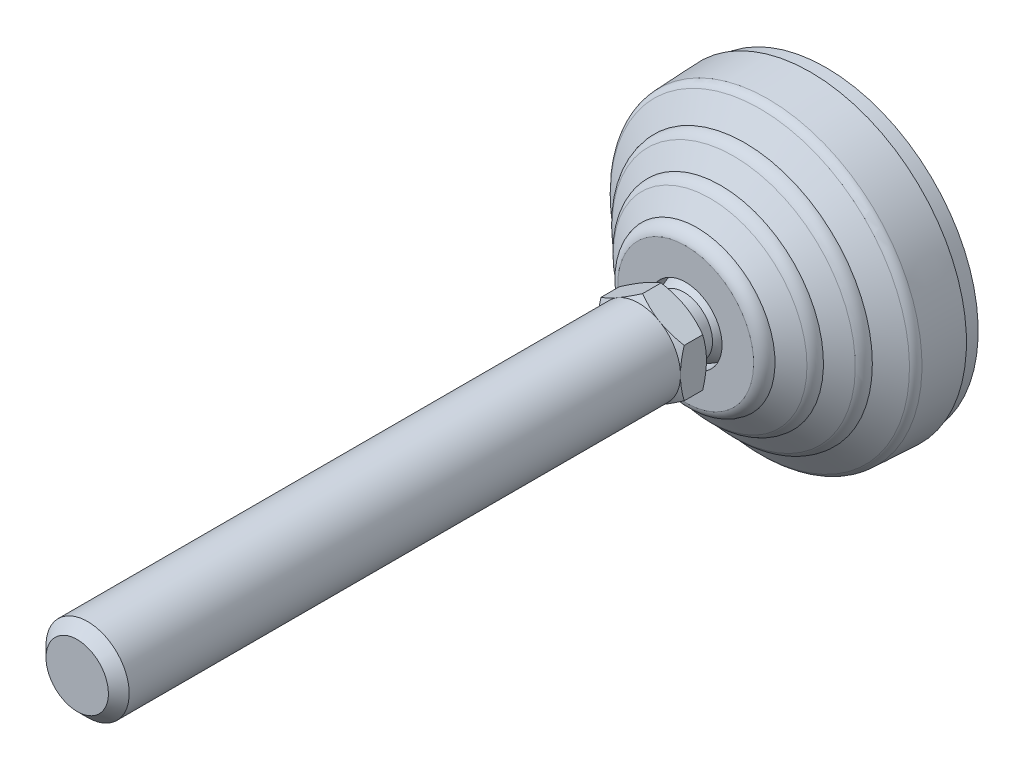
ISO-10303-21;
HEADER;
FILE_DESCRIPTION(('STEP AP214'),'2;1');
FILE_NAME('part.step','',(''),(''),'','','');
FILE_SCHEMA(('AUTOMOTIVE_DESIGN { 1 0 10303 214 1 1 1 1 }'));
ENDSEC;
DATA;
#1=APPLICATION_CONTEXT('core data for automotive mechanical design processes');
#2=APPLICATION_PROTOCOL_DEFINITION('international standard','automotive_design',2000,#1);
#3=PRODUCT_CONTEXT('',#1,'mechanical');
#4=PRODUCT('Part','Part','',(#3));
#5=PRODUCT_RELATED_PRODUCT_CATEGORY('part','',(#4));
#6=PRODUCT_DEFINITION_FORMATION('','',#4);
#7=PRODUCT_DEFINITION_CONTEXT('part definition',#1,'design');
#8=PRODUCT_DEFINITION('design','',#6,#7);
#9=PRODUCT_DEFINITION_SHAPE('','',#8);
#10=(LENGTH_UNIT() NAMED_UNIT(*) SI_UNIT(.MILLI.,.METRE.));
#11=(NAMED_UNIT(*) PLANE_ANGLE_UNIT() SI_UNIT($,.RADIAN.));
#12=(NAMED_UNIT(*) SI_UNIT($,.STERADIAN.) SOLID_ANGLE_UNIT());
#13=UNCERTAINTY_MEASURE_WITH_UNIT(LENGTH_MEASURE(1.E-05),#10,'distance_accuracy_value','');
#14=(GEOMETRIC_REPRESENTATION_CONTEXT(3) GLOBAL_UNCERTAINTY_ASSIGNED_CONTEXT((#13)) GLOBAL_UNIT_ASSIGNED_CONTEXT((#10,
#11,#12)) REPRESENTATION_CONTEXT('',''));
#15=CARTESIAN_POINT('',(0.,0.,0.));
#16=DIRECTION('',(0.,0.,1.));
#17=DIRECTION('',(1.,0.,0.));
#18=AXIS2_PLACEMENT_3D('',#15,#16,#17);
#19=CARTESIAN_POINT('',(0.,0.,35.2753734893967));
#20=DIRECTION('',(0.,0.,-1.));
#21=DIRECTION('',(0.,1.,0.));
#22=AXIS2_PLACEMENT_3D('',#19,#20,#21);
#23=CONICAL_SURFACE('',#22,9.2450899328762,1.0471975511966);
#24=CARTESIAN_POINT('',(0.,0.,36.));
#25=DIRECTION('',(0.,0.,-1.));
#26=DIRECTION('',(0.,1.,0.));
#27=AXIS2_PLACEMENT_3D('',#24,#25,#26);
#28=CIRCLE('',#27,7.99);
#29=CARTESIAN_POINT('',(0.,7.99,36.));
#30=VERTEX_POINT('',#29);
#31=EDGE_CURVE('E124',#30,#30,#28,.F.);
#32=ORIENTED_EDGE('',*,*,#31,.F.);
#33=EDGE_LOOP('',(#32));
#34=FACE_BOUND('',#33,.T.);
#35=CARTESIAN_POINT('',(-4.19327850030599E-08,-9.23760428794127,35.2796952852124));
#36=CARTESIAN_POINT('',(0.175847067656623,-9.13607893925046,35.3382996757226));
#37=CARTESIAN_POINT('',(0.352349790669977,-9.03417505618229,35.3942441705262));
#38=CARTESIAN_POINT('',(0.706788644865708,-8.82953969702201,35.5000807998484));
#39=CARTESIAN_POINT('',(0.884725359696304,-8.72680788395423,35.5499703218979));
#40=CARTESIAN_POINT('',(1.42138431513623,-8.41696768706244,35.6895770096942));
#41=CARTESIAN_POINT('',(1.78222493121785,-8.20863626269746,35.7689823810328));
#42=CARTESIAN_POINT('',(2.32221590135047,-7.896872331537,35.862092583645));
#43=CARTESIAN_POINT('',(2.49975318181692,-7.79437113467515,35.8886165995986));
#44=CARTESIAN_POINT('',(2.85563052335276,-7.58890525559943,35.9330919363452));
#45=CARTESIAN_POINT('',(3.03397051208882,-7.48594061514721,35.9510440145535));
#46=CARTESIAN_POINT('',(3.3909574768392,-7.27983409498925,35.9779205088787));
#47=CARTESIAN_POINT('',(3.56960387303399,-7.17669255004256,35.9868551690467));
#48=CARTESIAN_POINT('',(3.92706158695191,-6.97031424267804,35.9955052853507));
#49=CARTESIAN_POINT('',(4.10587289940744,-6.86707748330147,35.995221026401));
#50=CARTESIAN_POINT('',(4.44015430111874,-6.67408002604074,35.9860752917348));
#51=CARTESIAN_POINT('',(4.59564800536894,-6.58430569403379,35.9783294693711));
#52=CARTESIAN_POINT('',(4.90627121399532,-6.4049673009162,35.956016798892));
#53=CARTESIAN_POINT('',(5.06140069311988,-6.31540325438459,35.9414494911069));
#54=CARTESIAN_POINT('',(5.52618852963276,-6.04705787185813,35.8878596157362));
#55=CARTESIAN_POINT('',(5.83502420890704,-5.86875150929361,35.8389557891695));
#56=CARTESIAN_POINT('',(6.455971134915,-5.51024763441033,35.7166979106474));
#57=CARTESIAN_POINT('',(6.76800315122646,-5.33009586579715,35.6428257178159));
#58=CARTESIAN_POINT('',(7.38741452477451,-4.97247854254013,35.4751673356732));
#59=CARTESIAN_POINT('',(7.69480181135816,-4.79500840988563,35.3814205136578));
#60=CARTESIAN_POINT('',(7.9999999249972,-4.6188021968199,35.2796953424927));
#61=B_SPLINE_CURVE_WITH_KNOTS('',3,(#35,#36,#37,#38,#39,#40,#41,#42,#43,#44,#45,#46,#47,#48,#49,
#50,#51,#52,#53,#54,#55,#56,#57,#58,#59,#60),.UNSPECIFIED.,.F.,.F.,(4,2,2,2,2,2,2,2,2,2,2,2,4),
(0.,0.633965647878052,1.26820386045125,2.53931509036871,3.15930425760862,3.77923863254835,
4.39846794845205,5.01767812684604,5.55669080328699,6.09573980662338,7.17460542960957,
8.2773951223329,9.37802050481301),.UNSPECIFIED.);
#62=CARTESIAN_POINT('',(-1.44240226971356E-08,-9.23760431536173,35.2796953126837));
#63=VERTEX_POINT('',#62);
#64=CARTESIAN_POINT('',(8.,-4.61880217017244,35.2796953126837));
#65=VERTEX_POINT('',#64);
#66=EDGE_CURVE('E140',#63,#65,#61,.T.);
#67=ORIENTED_EDGE('',*,*,#66,.T.);
#68=CARTESIAN_POINT('',(7.9999999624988,-4.6188021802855,35.2796952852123));
#69=CARTESIAN_POINT('',(7.99999998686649,-4.23969380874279,35.3891659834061));
#70=CARTESIAN_POINT('',(7.999999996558,-3.85751175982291,35.4893813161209));
#71=CARTESIAN_POINT('',(8.00000000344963,-3.08693961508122,35.6664987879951));
#72=CARTESIAN_POINT('',(8.00000000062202,-2.69853763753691,35.7433487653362));
#73=CARTESIAN_POINT('',(7.99999999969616,-2.11699996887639,35.8364192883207));
#74=CARTESIAN_POINT('',(7.99999999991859,-1.92560834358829,35.8635449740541));
#75=CARTESIAN_POINT('',(8.0000000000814,-1.54193621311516,35.9104602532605));
#76=CARTESIAN_POINT('',(8.0000000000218,-1.34965578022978,35.9302504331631));
#77=CARTESIAN_POINT('',(7.99999999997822,-0.96464588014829,35.962068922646));
#78=CARTESIAN_POINT('',(7.99999999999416,-0.771917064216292,35.9741050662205));
#79=CARTESIAN_POINT('',(8.00000000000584,-0.386125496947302,35.9901838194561));
#80=CARTESIAN_POINT('',(8.00000000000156,-0.193062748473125,35.9942264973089));
#81=CARTESIAN_POINT('',(7.99999999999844,0.193062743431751,35.9942264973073));
#82=CARTESIAN_POINT('',(7.99999999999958,0.38612548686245,35.9901838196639));
#83=CARTESIAN_POINT('',(8.00000000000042,0.771917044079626,35.9741050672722));
#84=CARTESIAN_POINT('',(8.00000000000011,0.964645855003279,35.962068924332));
#85=CARTESIAN_POINT('',(7.99999999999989,1.34965574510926,35.930250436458));
#86=CARTESIAN_POINT('',(7.99999999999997,1.54193617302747,35.9104602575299));
#87=CARTESIAN_POINT('',(8.00000000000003,1.92560829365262,35.8635449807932));
#88=CARTESIAN_POINT('',(8.00000000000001,2.11699991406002,35.8364192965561));
#89=CARTESIAN_POINT('',(7.99999999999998,2.69853756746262,35.7433487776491));
#90=CARTESIAN_POINT('',(7.99999999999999,3.0869395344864,35.6664988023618));
#91=CARTESIAN_POINT('',(8.00000000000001,3.85751166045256,35.4893813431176));
#92=CARTESIAN_POINT('',(8.00000000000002,4.23969370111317,35.3891660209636));
#93=CARTESIAN_POINT('',(8.,4.61880206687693,35.2796953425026));
#94=B_SPLINE_CURVE_WITH_KNOTS('',3,(#68,#69,#70,#71,#72,#73,#74,#75,#76,#77,#78,#79,#80,#81,#82,
#83,#84,#85,#86,#87,#88,#89,#90,#91,#92,#93),.UNSPECIFIED.,.F.,.F.,(4,2,2,2,2,2,2,2,2,2,2,2,4),
(0.,1.1842935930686,2.37121196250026,2.95099639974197,3.53073447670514,4.10988591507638,
4.68903241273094,5.26817889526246,5.84733031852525,6.42706838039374,7.00685280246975,
8.19377114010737,9.37806470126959),.UNSPECIFIED.);
#95=CARTESIAN_POINT('',(8.00000001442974,4.618802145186,35.2796953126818));
#96=VERTEX_POINT('',#95);
#97=EDGE_CURVE('E132',#65,#96,#94,.T.);
#98=ORIENTED_EDGE('',*,*,#97,.T.);
#99=CARTESIAN_POINT('',(8.00000000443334,4.61880210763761,35.2796952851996));
#100=CARTESIAN_POINT('',(7.82415291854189,4.72032749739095,35.3382996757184));
#101=CARTESIAN_POINT('',(7.64765020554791,4.8222313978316,35.3942441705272));
#102=CARTESIAN_POINT('',(7.29321135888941,5.02686677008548,35.500080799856));
#103=CARTESIAN_POINT('',(7.11527464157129,5.12959857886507,35.549970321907));
#104=CARTESIAN_POINT('',(6.57861568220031,5.43943876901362,35.689577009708));
#105=CARTESIAN_POINT('',(6.21777506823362,5.6477701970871,35.7689823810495));
#106=CARTESIAN_POINT('',(5.67778409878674,5.95953412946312,35.8620925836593));
#107=CARTESIAN_POINT('',(5.50024681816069,6.06203532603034,35.8886165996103));
#108=CARTESIAN_POINT('',(5.14436947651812,6.2675012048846,35.9330919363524));
#109=CARTESIAN_POINT('',(4.96602948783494,6.37046584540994,35.9510440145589));
#110=CARTESIAN_POINT('',(4.60904252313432,6.57657236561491,35.977920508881));
#111=CARTESIAN_POINT('',(4.43039612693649,6.6797139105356,35.986855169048));
#112=CARTESIAN_POINT('',(4.0729384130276,6.88609221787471,35.9955052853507));
#113=CARTESIAN_POINT('',(3.89412710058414,6.98932897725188,35.9952210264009));
#114=CARTESIAN_POINT('',(3.55984569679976,7.18232643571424,35.9860752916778));
#115=CARTESIAN_POINT('',(3.40435199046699,7.27210076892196,35.9783294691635));
#116=CARTESIAN_POINT('',(3.09372877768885,7.45143916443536,35.956016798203));
#117=CARTESIAN_POINT('',(2.9385992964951,7.54100321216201,35.9414494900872));
#118=CARTESIAN_POINT('',(2.47381145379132,7.80934859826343,35.8878596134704));
#119=CARTESIAN_POINT('',(2.16497577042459,7.98765496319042,35.8389557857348));
#120=CARTESIAN_POINT('',(1.54402883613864,8.34615884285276,35.7166979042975));
#121=CARTESIAN_POINT('',(1.23199681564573,8.52631061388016,35.6428257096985));
#122=CARTESIAN_POINT('',(0.612585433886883,8.88392794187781,35.4751673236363));
#123=CARTESIAN_POINT('',(0.305198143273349,9.06139807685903,35.3814204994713));
#124=CARTESIAN_POINT('',(2.56600557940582E-08,9.23760429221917,35.2796953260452));
#125=B_SPLINE_CURVE_WITH_KNOTS('',3,(#99,#100,#101,#102,#103,#104,#105,#106,#107,#108,#109,#110,
#111,#112,#113,#114,#115,#116,#117,#118,#119,#120,#121,#122,#123,#124),.UNSPECIFIED.,.F.,.F.,(4,
2,2,2,2,2,2,2,2,2,2,2,4),(0.,0.63396564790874,1.26820386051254,2.53931509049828,
3.15930425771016,3.77923863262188,4.39846794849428,5.01767812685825,5.55669081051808,
6.0957398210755,7.17460545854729,8.27739516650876,9.37802056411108),.UNSPECIFIED.);
#126=CARTESIAN_POINT('',(-1.1538685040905E-08,9.23760430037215,35.279695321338));
#127=VERTEX_POINT('',#126);
#128=EDGE_CURVE('E176',#96,#127,#125,.T.);
#129=ORIENTED_EDGE('',*,*,#128,.T.);
#130=CARTESIAN_POINT('',(-1.65350869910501E-08,9.23760427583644,35.2796953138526));
#131=CARTESIAN_POINT('',(-0.175847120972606,9.13607891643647,35.3382996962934));
#132=CARTESIAN_POINT('',(-0.352349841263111,9.03417502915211,35.3942441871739));
#133=CARTESIAN_POINT('',(-0.7067886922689,8.82953966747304,35.5000808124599));
#134=CARTESIAN_POINT('',(-0.884725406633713,8.72680785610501,35.5499703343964));
#135=CARTESIAN_POINT('',(-1.42138436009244,8.41696766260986,35.6895770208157));
#136=CARTESIAN_POINT('',(-1.78222497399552,8.2086362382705,35.7689823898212));
#137=CARTESIAN_POINT('',(-2.32221594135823,7.89687230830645,35.8620925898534));
#138=CARTESIAN_POINT('',(-2.4997532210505,7.79437111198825,35.8886166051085));
#139=CARTESIAN_POINT('',(-2.85563056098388,7.58890523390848,35.9330919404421));
#140=CARTESIAN_POINT('',(-3.03397054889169,7.48594059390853,35.9510440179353));
#141=CARTESIAN_POINT('',(-3.39095751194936,7.27983407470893,35.9779205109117));
#142=CARTESIAN_POINT('',(-3.56960390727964,7.1766925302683,35.9868551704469));
#143=CARTESIAN_POINT('',(-3.92706161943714,6.97031422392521,35.9955052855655));
#144=CARTESIAN_POINT('',(-4.10587293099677,6.86707746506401,35.9952210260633));
#145=CARTESIAN_POINT('',(-4.44015433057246,6.67408000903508,35.9860752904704));
#146=CARTESIAN_POINT('',(-4.59564803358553,6.58430567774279,35.9783294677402));
#147=CARTESIAN_POINT('',(-4.90627123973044,6.40496728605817,35.956016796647));
#148=CARTESIAN_POINT('',(-5.06140071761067,6.31540324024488,35.9414494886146));
#149=CARTESIAN_POINT('',(-5.52618855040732,6.04705785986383,35.8878596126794));
#150=CARTESIAN_POINT('',(-5.83502422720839,5.8687514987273,35.8389557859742));
#151=CARTESIAN_POINT('',(-6.45597114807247,5.51024762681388,35.7166979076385));
#152=CARTESIAN_POINT('',(-6.76800316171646,5.33009585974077,35.6428257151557));
#153=CARTESIAN_POINT('',(-7.38741452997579,4.97247853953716,35.4751673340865));
#154=CARTESIAN_POINT('',(-7.69480181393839,4.7950084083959,35.381420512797));
#155=CARTESIAN_POINT('',(-7.9999999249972,4.6188021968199,35.2796953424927));
#156=B_SPLINE_CURVE_WITH_KNOTS('',3,(#130,#131,#132,#133,#134,#135,#136,#137,#138,#139,#140,
#141,#142,#143,#144,#145,#146,#147,#148,#149,#150,#151,#152,#153,#154,#155),.UNSPECIFIED.,.F.,
.F.,(4,2,2,2,2,2,2,2,2,2,2,2,4),(0.,0.633965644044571,1.26820385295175,2.53931507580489,
3.15930423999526,3.77923861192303,4.39846792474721,5.01767810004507,5.55669077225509,
6.09573977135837,7.17460538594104,8.27739506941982,9.37802044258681),.UNSPECIFIED.);
#157=CARTESIAN_POINT('',(-8.,4.61880217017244,35.2796953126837));
#158=VERTEX_POINT('',#157);
#159=EDGE_CURVE('E168',#127,#158,#156,.T.);
#160=ORIENTED_EDGE('',*,*,#159,.T.);
#161=CARTESIAN_POINT('',(-7.9999999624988,4.6188021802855,35.2796952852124));
#162=CARTESIAN_POINT('',(-7.99999998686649,4.23969380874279,35.3891659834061));
#163=CARTESIAN_POINT('',(-7.999999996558,3.8575117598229,35.4893813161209));
#164=CARTESIAN_POINT('',(-8.00000000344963,3.08693961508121,35.6664987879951));
#165=CARTESIAN_POINT('',(-8.00000000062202,2.69853763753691,35.7433487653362));
#166=CARTESIAN_POINT('',(-7.99999999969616,2.11699996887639,35.8364192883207));
#167=CARTESIAN_POINT('',(-7.99999999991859,1.92560834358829,35.8635449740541));
#168=CARTESIAN_POINT('',(-8.0000000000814,1.54193621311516,35.9104602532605));
#169=CARTESIAN_POINT('',(-8.0000000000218,1.34965578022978,35.9302504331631));
#170=CARTESIAN_POINT('',(-7.99999999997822,0.964645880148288,35.962068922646));
#171=CARTESIAN_POINT('',(-7.99999999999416,0.77191706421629,35.9741050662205));
#172=CARTESIAN_POINT('',(-8.00000000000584,0.386125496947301,35.9901838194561));
#173=CARTESIAN_POINT('',(-8.00000000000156,0.193062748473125,35.9942264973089));
#174=CARTESIAN_POINT('',(-7.99999999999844,-0.193062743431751,35.9942264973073));
#175=CARTESIAN_POINT('',(-7.99999999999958,-0.38612548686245,35.9901838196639));
#176=CARTESIAN_POINT('',(-8.00000000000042,-0.771917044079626,35.9741050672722));
#177=CARTESIAN_POINT('',(-8.00000000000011,-0.964645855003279,35.962068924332));
#178=CARTESIAN_POINT('',(-7.99999999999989,-1.34965574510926,35.930250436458));
#179=CARTESIAN_POINT('',(-7.99999999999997,-1.54193617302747,35.9104602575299));
#180=CARTESIAN_POINT('',(-8.00000000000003,-1.92560829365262,35.8635449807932));
#181=CARTESIAN_POINT('',(-8.00000000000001,-2.11699991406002,35.8364192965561));
#182=CARTESIAN_POINT('',(-7.99999999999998,-2.69853756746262,35.7433487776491));
#183=CARTESIAN_POINT('',(-7.99999999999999,-3.0869395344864,35.6664988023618));
#184=CARTESIAN_POINT('',(-8.00000000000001,-3.85751166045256,35.4893813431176));
#185=CARTESIAN_POINT('',(-8.00000000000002,-4.23969370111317,35.3891660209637));
#186=CARTESIAN_POINT('',(-8.,-4.61880206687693,35.2796953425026));
#187=B_SPLINE_CURVE_WITH_KNOTS('',3,(#161,#162,#163,#164,#165,#166,#167,#168,#169,#170,#171,
#172,#173,#174,#175,#176,#177,#178,#179,#180,#181,#182,#183,#184,#185,#186),.UNSPECIFIED.,.F.,
.F.,(4,2,2,2,2,2,2,2,2,2,2,2,4),(0.,1.1842935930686,2.37121196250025,2.95099639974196,
3.53073447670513,4.10988591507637,4.68903241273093,5.26817889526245,5.84733031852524,
6.42706838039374,7.00685280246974,8.19377114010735,9.37806470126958),.UNSPECIFIED.);
#188=CARTESIAN_POINT('',(-8.00000001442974,-4.61880214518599,35.2796953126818));
#189=VERTEX_POINT('',#188);
#190=EDGE_CURVE('E358',#158,#189,#187,.T.);
#191=ORIENTED_EDGE('',*,*,#190,.T.);
#192=CARTESIAN_POINT('',(-8.00000000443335,-4.61880210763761,35.2796952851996));
#193=CARTESIAN_POINT('',(-7.82415291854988,-4.72032749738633,35.3382996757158));
#194=CARTESIAN_POINT('',(-7.64765020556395,-4.82223139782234,35.3942441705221));
#195=CARTESIAN_POINT('',(-7.29321135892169,-5.02686677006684,35.5000807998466));
#196=CARTESIAN_POINT('',(-7.11527464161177,-5.1295985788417,35.5499703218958));
#197=CARTESIAN_POINT('',(-6.57861568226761,-5.43943876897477,35.6895770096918));
#198=CARTESIAN_POINT('',(-6.21777506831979,-5.64777019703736,35.7689823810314));
#199=CARTESIAN_POINT('',(-5.67778409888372,-5.95953412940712,35.8620925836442));
#200=CARTESIAN_POINT('',(-5.50024681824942,-6.06203532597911,35.8886165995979));
#201=CARTESIAN_POINT('',(-5.14436947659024,-6.26750120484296,35.9330919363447));
#202=CARTESIAN_POINT('',(-4.9660294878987,-6.37046584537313,35.9510440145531));
#203=CARTESIAN_POINT('',(-4.60904252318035,-6.57657236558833,35.9779205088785));
#204=CARTESIAN_POINT('',(-4.43039612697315,-6.67971391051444,35.9868551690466));
#205=CARTESIAN_POINT('',(-4.07293841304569,-6.88609221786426,35.9955052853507));
#206=CARTESIAN_POINT('',(-3.89412710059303,-6.98932897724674,35.995221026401));
#207=CARTESIAN_POINT('',(-3.55984569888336,-7.18232643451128,35.9860752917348));
#208=CARTESIAN_POINT('',(-3.40435199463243,-7.27210076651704,35.9783294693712));
#209=CARTESIAN_POINT('',(-3.09372878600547,-7.45143915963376,35.9560167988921));
#210=CARTESIAN_POINT('',(-2.93859930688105,-7.54100320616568,35.941449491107));
#211=CARTESIAN_POINT('',(-2.47381147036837,-7.80934858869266,35.8878596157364));
#212=CARTESIAN_POINT('',(-2.16497579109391,-7.98765495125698,35.8389557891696));
#213=CARTESIAN_POINT('',(-1.54402886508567,-8.34615882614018,35.7166979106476));
#214=CARTESIAN_POINT('',(-1.23199684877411,-8.52631059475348,35.642825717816));
#215=CARTESIAN_POINT('',(-0.612585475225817,-8.88392791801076,35.4751673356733));
#216=CARTESIAN_POINT('',(-0.305198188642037,-9.06139805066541,35.3814205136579));
#217=CARTESIAN_POINT('',(-7.50027841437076E-08,-9.23760426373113,35.2796953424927));
#218=B_SPLINE_CURVE_WITH_KNOTS('',3,(#192,#193,#194,#195,#196,#197,#198,#199,#200,#201,#202,
#203,#204,#205,#206,#207,#208,#209,#210,#211,#212,#213,#214,#215,#216,#217),.UNSPECIFIED.,.F.,
.F.,(4,2,2,2,2,2,2,2,2,2,2,2,4),(0.,0.633965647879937,1.26820386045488,2.53931509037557,
3.15930425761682,3.77923863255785,4.39846794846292,5.01767812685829,5.55669080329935,
6.09573980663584,7.17460542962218,8.27739512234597,9.37802050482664),.UNSPECIFIED.);
#219=EDGE_CURVE('E158',#189,#63,#218,.T.);
#220=ORIENTED_EDGE('',*,*,#219,.T.);
#221=EDGE_LOOP('',(#67,#98,#129,#160,#191,#220));
#222=FACE_BOUND('',#221,.T.);
#223=ADVANCED_FACE('F14',(#34,#222),#23,.T.);
#224=CARTESIAN_POINT('',(0.,-9.23760430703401,36.1));
#225=DIRECTION('',(0.5,0.866025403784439,0.));
#226=DIRECTION('',(-0.866025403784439,0.5,0.));
#227=AXIS2_PLACEMENT_3D('',#224,#225,#226);
#228=PLANE('',#227);
#229=DIRECTION('',(0.,0.,1.));
#230=VECTOR('',#229,1.);
#231=CARTESIAN_POINT('',(0.,-9.23760430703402,36.1));
#232=LINE('',#231,#230);
#233=CARTESIAN_POINT('',(0.,-9.23760430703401,31.7203046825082));
#234=VERTEX_POINT('',#233);
#235=EDGE_CURVE('E339',#234,#63,#232,.T.);
#236=ORIENTED_EDGE('',*,*,#235,.T.);
#237=ORIENTED_EDGE('',*,*,#219,.F.);
#238=DIRECTION('',(0.,0.,1.));
#239=VECTOR('',#238,1.);
#240=CARTESIAN_POINT('',(-8.,-4.61880215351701,36.1));
#241=LINE('',#240,#239);
#242=CARTESIAN_POINT('',(-8.,-4.61880215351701,31.7203046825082));
#243=VERTEX_POINT('',#242);
#244=EDGE_CURVE('E342',#243,#189,#241,.T.);
#245=ORIENTED_EDGE('',*,*,#244,.F.);
#246=CARTESIAN_POINT('',(0.,-9.23760430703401,31.7203046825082));
#247=CARTESIAN_POINT('',(-0.175847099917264,-9.13607893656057,31.6617003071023));
#248=CARTESIAN_POINT('',(-0.352349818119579,-9.03417504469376,31.6057558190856));
#249=CARTESIAN_POINT('',(-0.706788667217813,-8.82953967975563,31.4999191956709));
#250=CARTESIAN_POINT('',(-0.884725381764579,-8.72680786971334,31.4500296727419));
#251=CARTESIAN_POINT('',(-1.42138433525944,-8.41696767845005,31.3104229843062));
#252=CARTESIAN_POINT('',(-1.78222494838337,-8.20863625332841,31.2310176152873));
#253=CARTESIAN_POINT('',(-2.32221591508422,-7.8968723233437,31.1379074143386));
#254=CARTESIAN_POINT('',(-2.49975319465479,-7.79437112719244,31.1113833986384));
#255=CARTESIAN_POINT('',(-2.85563053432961,-7.5889052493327,31.0669080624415));
#256=CARTESIAN_POINT('',(-3.03397052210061,-7.48594060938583,31.0489559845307));
#257=CARTESIAN_POINT('',(-3.39095748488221,-7.27983409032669,31.0220794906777));
#258=CARTESIAN_POINT('',(-3.56960388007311,-7.17669254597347,31.0131448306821));
#259=CARTESIAN_POINT('',(-3.9270615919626,-6.97031423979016,31.0044947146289));
#260=CARTESIAN_POINT('',(-4.10587290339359,-6.86707748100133,31.0047789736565));
#261=CARTESIAN_POINT('',(-4.44015430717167,-6.67408002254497,31.0139247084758));
#262=CARTESIAN_POINT('',(-4.59564801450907,-6.58430568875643,31.0216705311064));
#263=CARTESIAN_POINT('',(-4.90627122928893,-6.40496729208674,31.0439832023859));
#264=CARTESIAN_POINT('',(-5.06140071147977,-6.3154032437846,31.0585505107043));
#265=CARTESIAN_POINT('',(-5.52618855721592,-6.04705785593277,31.1121403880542));
#266=CARTESIAN_POINT('',(-5.83502424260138,-5.86875148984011,31.161044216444));
#267=CARTESIAN_POINT('',(-6.4559711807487,-5.51024760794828,31.283302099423));
#268=CARTESIAN_POINT('',(-6.76800320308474,-5.33009583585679,31.3571742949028));
#269=CARTESIAN_POINT('',(-7.38741458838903,-4.97247850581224,31.5248326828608));
#270=CARTESIAN_POINT('',(-7.69480188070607,-4.79500836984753,31.6185795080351));
#271=CARTESIAN_POINT('',(-8.,-4.61880215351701,31.7203046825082));
#272=B_SPLINE_CURVE_WITH_KNOTS('',3,(#246,#247,#248,#249,#250,#251,#252,#253,#254,#255,#256,
#257,#258,#259,#260,#261,#262,#263,#264,#265,#266,#267,#268,#269,#270,#271),.UNSPECIFIED.,.F.,
.F.,(4,2,2,2,2,2,2,2,2,2,2,2,4),(0.,0.633965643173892,1.26820385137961,2.53931507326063,
3.15930423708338,3.77923860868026,4.39846792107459,5.01767809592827,5.55669078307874,
6.09573979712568,7.17460544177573,8.27739515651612,9.37802056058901),.UNSPECIFIED.);
#273=EDGE_CURVE('E341',#234,#243,#272,.T.);
#274=ORIENTED_EDGE('',*,*,#273,.F.);
#275=EDGE_LOOP('',(#236,#237,#245,#274));
#276=FACE_BOUND('',#275,.T.);
#277=ADVANCED_FACE('F152',(#276),#228,.F.);
#278=CARTESIAN_POINT('',(8.,-4.61880215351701,36.1));
#279=DIRECTION('',(-0.5,0.866025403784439,0.));
#280=DIRECTION('',(-0.866025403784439,-0.5,0.));
#281=AXIS2_PLACEMENT_3D('',#278,#279,#280);
#282=PLANE('',#281);
#283=DIRECTION('',(0.,0.,1.));
#284=VECTOR('',#283,1.);
#285=CARTESIAN_POINT('',(8.,-4.61880215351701,36.1));
#286=LINE('',#285,#284);
#287=CARTESIAN_POINT('',(8.,-4.61880215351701,31.7203046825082));
#288=VERTEX_POINT('',#287);
#289=EDGE_CURVE('E31',#288,#65,#286,.T.);
#290=ORIENTED_EDGE('',*,*,#289,.T.);
#291=ORIENTED_EDGE('',*,*,#66,.F.);
#292=ORIENTED_EDGE('',*,*,#235,.F.);
#293=CARTESIAN_POINT('',(8.,-4.61880215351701,31.7203046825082));
#294=CARTESIAN_POINT('',(7.82415290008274,-4.72032752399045,31.6617003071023));
#295=CARTESIAN_POINT('',(7.64765018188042,-4.82223141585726,31.6057558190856));
#296=CARTESIAN_POINT('',(7.29321133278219,-5.02686678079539,31.4999191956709));
#297=CARTESIAN_POINT('',(7.11527461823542,-5.12959859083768,31.4500296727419));
#298=CARTESIAN_POINT('',(6.57861566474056,-5.43943878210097,31.3104229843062));
#299=CARTESIAN_POINT('',(6.21777505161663,-5.64777020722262,31.2310176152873));
#300=CARTESIAN_POINT('',(5.67778408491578,-5.95953413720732,31.1379074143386));
#301=CARTESIAN_POINT('',(5.5002468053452,-6.06203533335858,31.1113833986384));
#302=CARTESIAN_POINT('',(5.14436946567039,-6.26750121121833,31.0669080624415));
#303=CARTESIAN_POINT('',(4.96602947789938,-6.37046585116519,31.0489559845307));
#304=CARTESIAN_POINT('',(4.60904251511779,-6.57657237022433,31.0220794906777));
#305=CARTESIAN_POINT('',(4.43039611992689,-6.67971391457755,31.0131448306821));
#306=CARTESIAN_POINT('',(4.0729384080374,-6.88609222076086,31.0044947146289));
#307=CARTESIAN_POINT('',(3.8941270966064,-6.98932897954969,31.0047789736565));
#308=CARTESIAN_POINT('',(3.55984569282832,-7.18232643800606,31.0139247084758));
#309=CARTESIAN_POINT('',(3.40435198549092,-7.27210077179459,31.0216705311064));
#310=CARTESIAN_POINT('',(3.09372877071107,-7.45143916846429,31.0439832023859));
#311=CARTESIAN_POINT('',(2.93859928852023,-7.54100321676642,31.0585505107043));
#312=CARTESIAN_POINT('',(2.47381144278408,-7.80934860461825,31.1121403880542));
#313=CARTESIAN_POINT('',(2.16497575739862,-7.98765497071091,31.161044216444));
#314=CARTESIAN_POINT('',(1.5440288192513,-8.34615885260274,31.283302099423));
#315=CARTESIAN_POINT('',(1.23199679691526,-8.52631062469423,31.3571742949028));
#316=CARTESIAN_POINT('',(0.612585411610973,-8.88392795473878,31.5248326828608));
#317=CARTESIAN_POINT('',(0.305198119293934,-9.0613980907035,31.6185795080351));
#318=CARTESIAN_POINT('',(0.,-9.23760430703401,31.7203046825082));
#319=B_SPLINE_CURVE_WITH_KNOTS('',3,(#293,#294,#295,#296,#297,#298,#299,#300,#301,#302,#303,
#304,#305,#306,#307,#308,#309,#310,#311,#312,#313,#314,#315,#316,#317,#318),.UNSPECIFIED.,.F.,
.F.,(4,2,2,2,2,2,2,2,2,2,2,2,4),(0.,0.633965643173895,1.26820385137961,2.53931507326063,
3.15930423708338,3.77923860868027,4.3984679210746,5.01767809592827,5.55669078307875,
6.09573979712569,7.17460544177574,8.27739515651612,9.37802056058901),.UNSPECIFIED.);
#320=EDGE_CURVE('E338',#288,#234,#319,.T.);
#321=ORIENTED_EDGE('',*,*,#320,.F.);
#322=EDGE_LOOP('',(#290,#291,#292,#321));
#323=FACE_BOUND('',#322,.T.);
#324=ADVANCED_FACE('F365',(#323),#282,.F.);
#325=CARTESIAN_POINT('',(-8.,4.61880215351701,36.1));
#326=DIRECTION('',(0.5,-0.866025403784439,0.));
#327=DIRECTION('',(0.866025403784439,0.5,0.));
#328=AXIS2_PLACEMENT_3D('',#325,#326,#327);
#329=PLANE('',#328);
#330=DIRECTION('',(0.,0.,1.));
#331=VECTOR('',#330,1.);
#332=CARTESIAN_POINT('',(-8.,4.61880215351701,36.1));
#333=LINE('',#332,#331);
#334=CARTESIAN_POINT('',(-8.,4.61880215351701,31.7203046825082));
#335=VERTEX_POINT('',#334);
#336=EDGE_CURVE('E345',#335,#158,#333,.T.);
#337=ORIENTED_EDGE('',*,*,#336,.T.);
#338=ORIENTED_EDGE('',*,*,#159,.F.);
#339=DIRECTION('',(0.,0.,1.));
#340=VECTOR('',#339,1.);
#341=CARTESIAN_POINT('',(0.,9.23760430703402,36.1));
#342=LINE('',#341,#340);
#343=CARTESIAN_POINT('',(0.,9.23760430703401,31.7203046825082));
#344=VERTEX_POINT('',#343);
#345=EDGE_CURVE('E207',#344,#127,#342,.T.);
#346=ORIENTED_EDGE('',*,*,#345,.F.);
#347=CARTESIAN_POINT('',(-8.,4.61880215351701,31.7203046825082));
#348=CARTESIAN_POINT('',(-7.82415290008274,4.72032752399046,31.6617003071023));
#349=CARTESIAN_POINT('',(-7.64765018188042,4.82223141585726,31.6057558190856));
#350=CARTESIAN_POINT('',(-7.29321133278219,5.02686678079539,31.4999191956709));
#351=CARTESIAN_POINT('',(-7.11527461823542,5.12959859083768,31.4500296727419));
#352=CARTESIAN_POINT('',(-6.57861566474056,5.43943878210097,31.3104229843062));
#353=CARTESIAN_POINT('',(-6.21777505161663,5.64777020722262,31.2310176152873));
#354=CARTESIAN_POINT('',(-5.67778408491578,5.95953413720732,31.1379074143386));
#355=CARTESIAN_POINT('',(-5.50024680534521,6.06203533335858,31.1113833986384));
#356=CARTESIAN_POINT('',(-5.14436946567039,6.26750121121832,31.0669080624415));
#357=CARTESIAN_POINT('',(-4.96602947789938,6.37046585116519,31.0489559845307));
#358=CARTESIAN_POINT('',(-4.60904251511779,6.57657237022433,31.0220794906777));
#359=CARTESIAN_POINT('',(-4.43039611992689,6.67971391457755,31.0131448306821));
#360=CARTESIAN_POINT('',(-4.07293840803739,6.88609222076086,31.0044947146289));
#361=CARTESIAN_POINT('',(-3.8941270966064,6.98932897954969,31.0047789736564));
#362=CARTESIAN_POINT('',(-3.55984569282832,7.18232643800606,31.0139247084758));
#363=CARTESIAN_POINT('',(-3.40435198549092,7.27210077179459,31.0216705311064));
#364=CARTESIAN_POINT('',(-3.09372877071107,7.45143916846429,31.0439832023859));
#365=CARTESIAN_POINT('',(-2.93859928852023,7.54100321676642,31.0585505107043));
#366=CARTESIAN_POINT('',(-2.47381144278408,7.80934860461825,31.1121403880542));
#367=CARTESIAN_POINT('',(-2.16497575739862,7.98765497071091,31.161044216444));
#368=CARTESIAN_POINT('',(-1.5440288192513,8.34615885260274,31.2833020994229));
#369=CARTESIAN_POINT('',(-1.23199679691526,8.52631062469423,31.3571742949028));
#370=CARTESIAN_POINT('',(-0.612585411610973,8.88392795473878,31.5248326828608));
#371=CARTESIAN_POINT('',(-0.305198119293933,9.06139809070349,31.6185795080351));
#372=CARTESIAN_POINT('',(0.,9.23760430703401,31.7203046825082));
#373=B_SPLINE_CURVE_WITH_KNOTS('',3,(#347,#348,#349,#350,#351,#352,#353,#354,#355,#356,#357,
#358,#359,#360,#361,#362,#363,#364,#365,#366,#367,#368,#369,#370,#371,#372),.UNSPECIFIED.,.F.,
.F.,(4,2,2,2,2,2,2,2,2,2,2,2,4),(0.,0.633965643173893,1.26820385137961,2.53931507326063,
3.15930423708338,3.77923860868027,4.3984679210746,5.01767809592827,5.55669078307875,
6.09573979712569,7.17460544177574,8.27739515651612,9.37802056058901),.UNSPECIFIED.);
#374=EDGE_CURVE('E209',#335,#344,#373,.T.);
#375=ORIENTED_EDGE('',*,*,#374,.F.);
#376=EDGE_LOOP('',(#337,#338,#346,#375));
#377=FACE_BOUND('',#376,.T.);
#378=ADVANCED_FACE('F195',(#377),#329,.F.);
#379=CARTESIAN_POINT('',(-8.,-4.61880215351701,36.1));
#380=DIRECTION('',(1.,0.,0.));
#381=DIRECTION('',(0.,1.,0.));
#382=AXIS2_PLACEMENT_3D('',#379,#380,#381);
#383=PLANE('',#382);
#384=ORIENTED_EDGE('',*,*,#244,.T.);
#385=ORIENTED_EDGE('',*,*,#190,.F.);
#386=ORIENTED_EDGE('',*,*,#336,.F.);
#387=CARTESIAN_POINT('',(-8.,-4.618802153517,31.7203046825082));
#388=CARTESIAN_POINT('',(-8.,-4.23969378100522,31.610834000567));
#389=CARTESIAN_POINT('',(-8.,-3.85751173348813,31.5106186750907));
#390=CARTESIAN_POINT('',(-8.,-3.08693959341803,31.3335012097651));
#391=CARTESIAN_POINT('',(-8.,-2.69853761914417,31.2566512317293));
#392=CARTESIAN_POINT('',(-8.,-2.11699995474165,31.163580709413));
#393=CARTESIAN_POINT('',(-8.,-1.92560833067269,31.1364550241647));
#394=CARTESIAN_POINT('',(-8.,-1.54193620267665,31.089539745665));
#395=CARTESIAN_POINT('',(-8.,-1.3496557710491,31.069749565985));
#396=CARTESIAN_POINT('',(-8.,-0.964645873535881,31.0379310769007));
#397=CARTESIAN_POINT('',(-8.,-0.771917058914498,31.0258949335));
#398=CARTESIAN_POINT('',(-8.,-0.386125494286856,31.0098161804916));
#399=CARTESIAN_POINT('',(-8.,-0.193062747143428,31.0057735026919));
#400=CARTESIAN_POINT('',(-8.,0.193062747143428,31.0057735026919));
#401=CARTESIAN_POINT('',(-8.,0.386125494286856,31.0098161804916));
#402=CARTESIAN_POINT('',(-8.,0.771917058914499,31.0258949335));
#403=CARTESIAN_POINT('',(-8.,0.964645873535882,31.0379310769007));
#404=CARTESIAN_POINT('',(-8.,1.3496557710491,31.069749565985));
#405=CARTESIAN_POINT('',(-8.,1.54193620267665,31.089539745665));
#406=CARTESIAN_POINT('',(-8.,1.9256083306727,31.1364550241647));
#407=CARTESIAN_POINT('',(-8.,2.11699995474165,31.163580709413));
#408=CARTESIAN_POINT('',(-8.,2.69853761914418,31.2566512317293));
#409=CARTESIAN_POINT('',(-8.,3.08693959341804,31.3335012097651));
#410=CARTESIAN_POINT('',(-8.,3.85751173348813,31.5106186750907));
#411=CARTESIAN_POINT('',(-8.,4.23969378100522,31.610834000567));
#412=CARTESIAN_POINT('',(-8.,4.61880215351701,31.7203046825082));
#413=B_SPLINE_CURVE_WITH_KNOTS('',3,(#387,#388,#389,#390,#391,#392,#393,#394,#395,#396,#397,
#398,#399,#400,#401,#402,#403,#404,#405,#406,#407,#408,#409,#410,#411,#412),.UNSPECIFIED.,.F.,
.F.,(4,2,2,2,2,2,2,2,2,2,2,2,4),(0.,1.18429358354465,2.37121194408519,2.95099637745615,
3.53073445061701,4.10988588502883,4.68903237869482,5.26817887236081,5.84733030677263,
6.42706837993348,7.00685281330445,8.19377117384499,9.37806475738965),.UNSPECIFIED.);
#414=EDGE_CURVE('E344',#243,#335,#413,.T.);
#415=ORIENTED_EDGE('',*,*,#414,.F.);
#416=EDGE_LOOP('',(#384,#385,#386,#415));
#417=FACE_BOUND('',#416,.T.);
#418=ADVANCED_FACE('F381',(#417),#383,.F.);
#419=CARTESIAN_POINT('',(8.,4.61880215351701,36.1));
#420=DIRECTION('',(-1.,0.,0.));
#421=DIRECTION('',(0.,-1.,0.));
#422=AXIS2_PLACEMENT_3D('',#419,#420,#421);
#423=PLANE('',#422);
#424=DIRECTION('',(0.,0.,1.));
#425=VECTOR('',#424,1.);
#426=CARTESIAN_POINT('',(8.,4.61880215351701,36.1));
#427=LINE('',#426,#425);
#428=CARTESIAN_POINT('',(8.,4.61880215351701,31.7203046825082));
#429=VERTEX_POINT('',#428);
#430=EDGE_CURVE('E335',#96,#429,#427,.F.);
#431=ORIENTED_EDGE('',*,*,#430,.F.);
#432=ORIENTED_EDGE('',*,*,#97,.F.);
#433=ORIENTED_EDGE('',*,*,#289,.F.);
#434=CARTESIAN_POINT('',(8.,4.618802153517,31.7203046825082));
#435=CARTESIAN_POINT('',(8.,4.23969378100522,31.610834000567));
#436=CARTESIAN_POINT('',(8.,3.85751173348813,31.5106186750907));
#437=CARTESIAN_POINT('',(8.,3.08693959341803,31.3335012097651));
#438=CARTESIAN_POINT('',(8.,2.69853761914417,31.2566512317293));
#439=CARTESIAN_POINT('',(8.,2.11699995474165,31.163580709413));
#440=CARTESIAN_POINT('',(8.,1.92560833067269,31.1364550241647));
#441=CARTESIAN_POINT('',(8.,1.54193620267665,31.089539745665));
#442=CARTESIAN_POINT('',(8.,1.3496557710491,31.069749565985));
#443=CARTESIAN_POINT('',(8.,0.964645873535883,31.0379310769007));
#444=CARTESIAN_POINT('',(8.,0.7719170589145,31.0258949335));
#445=CARTESIAN_POINT('',(8.,0.386125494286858,31.0098161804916));
#446=CARTESIAN_POINT('',(8.,0.19306274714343,31.0057735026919));
#447=CARTESIAN_POINT('',(8.,-0.193062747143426,31.0057735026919));
#448=CARTESIAN_POINT('',(8.,-0.386125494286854,31.0098161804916));
#449=CARTESIAN_POINT('',(8.,-0.771917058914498,31.0258949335));
#450=CARTESIAN_POINT('',(8.,-0.96464587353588,31.0379310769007));
#451=CARTESIAN_POINT('',(8.,-1.3496557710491,31.069749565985));
#452=CARTESIAN_POINT('',(8.,-1.54193620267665,31.089539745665));
#453=CARTESIAN_POINT('',(8.,-1.9256083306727,31.1364550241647));
#454=CARTESIAN_POINT('',(8.,-2.11699995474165,31.163580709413));
#455=CARTESIAN_POINT('',(8.,-2.69853761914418,31.2566512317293));
#456=CARTESIAN_POINT('',(8.,-3.08693959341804,31.3335012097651));
#457=CARTESIAN_POINT('',(8.,-3.85751173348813,31.5106186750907));
#458=CARTESIAN_POINT('',(8.,-4.23969378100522,31.610834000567));
#459=CARTESIAN_POINT('',(8.,-4.61880215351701,31.7203046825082));
#460=B_SPLINE_CURVE_WITH_KNOTS('',3,(#434,#435,#436,#437,#438,#439,#440,#441,#442,#443,#444,
#445,#446,#447,#448,#449,#450,#451,#452,#453,#454,#455,#456,#457,#458,#459),.UNSPECIFIED.,.F.,
.F.,(4,2,2,2,2,2,2,2,2,2,2,2,4),(0.,1.18429358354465,2.37121194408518,2.95099637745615,
3.53073445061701,4.10988588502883,4.68903237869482,5.26817887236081,5.84733030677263,
6.42706837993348,7.00685281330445,8.193771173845,9.37806475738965),.UNSPECIFIED.);
#461=EDGE_CURVE('E184',#429,#288,#460,.T.);
#462=ORIENTED_EDGE('',*,*,#461,.F.);
#463=EDGE_LOOP('',(#431,#432,#433,#462));
#464=FACE_BOUND('',#463,.T.);
#465=ADVANCED_FACE('F147',(#464),#423,.F.);
#466=CARTESIAN_POINT('',(0.,9.23760430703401,36.1));
#467=DIRECTION('',(-0.5,-0.866025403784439,0.));
#468=DIRECTION('',(0.866025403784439,-0.5,0.));
#469=AXIS2_PLACEMENT_3D('',#466,#467,#468);
#470=PLANE('',#469);
#471=ORIENTED_EDGE('',*,*,#345,.T.);
#472=ORIENTED_EDGE('',*,*,#128,.F.);
#473=ORIENTED_EDGE('',*,*,#430,.T.);
#474=CARTESIAN_POINT('',(0.,9.23760430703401,31.7203046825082));
#475=CARTESIAN_POINT('',(0.175847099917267,9.13607893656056,31.6617003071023));
#476=CARTESIAN_POINT('',(0.352349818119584,9.03417504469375,31.6057558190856));
#477=CARTESIAN_POINT('',(0.706788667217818,8.82953967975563,31.4999191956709));
#478=CARTESIAN_POINT('',(0.884725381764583,8.72680786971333,31.4500296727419));
#479=CARTESIAN_POINT('',(1.42138433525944,8.41696767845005,31.3104229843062));
#480=CARTESIAN_POINT('',(1.78222494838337,8.20863625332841,31.2310176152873));
#481=CARTESIAN_POINT('',(2.32221591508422,7.8968723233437,31.1379074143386));
#482=CARTESIAN_POINT('',(2.4997531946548,7.79437112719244,31.1113833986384));
#483=CARTESIAN_POINT('',(2.85563053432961,7.5889052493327,31.0669080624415));
#484=CARTESIAN_POINT('',(3.03397052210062,7.48594060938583,31.0489559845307));
#485=CARTESIAN_POINT('',(3.39095748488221,7.27983409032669,31.0220794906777));
#486=CARTESIAN_POINT('',(3.56960388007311,7.17669254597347,31.0131448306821));
#487=CARTESIAN_POINT('',(3.92706159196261,6.97031423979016,31.0044947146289));
#488=CARTESIAN_POINT('',(4.1058729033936,6.86707748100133,31.0047789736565));
#489=CARTESIAN_POINT('',(4.44015430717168,6.67408002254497,31.0139247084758));
#490=CARTESIAN_POINT('',(4.59564801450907,6.58430568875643,31.0216705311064));
#491=CARTESIAN_POINT('',(4.90627122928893,6.40496729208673,31.0439832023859));
#492=CARTESIAN_POINT('',(5.06140071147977,6.3154032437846,31.0585505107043));
#493=CARTESIAN_POINT('',(5.52618855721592,6.04705785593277,31.1121403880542));
#494=CARTESIAN_POINT('',(5.83502424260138,5.86875148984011,31.161044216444));
#495=CARTESIAN_POINT('',(6.4559711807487,5.51024760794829,31.2833020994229));
#496=CARTESIAN_POINT('',(6.76800320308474,5.33009583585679,31.3571742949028));
#497=CARTESIAN_POINT('',(7.38741458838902,4.97247850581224,31.5248326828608));
#498=CARTESIAN_POINT('',(7.69480188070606,4.79500836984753,31.6185795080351));
#499=CARTESIAN_POINT('',(8.,4.61880215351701,31.7203046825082));
#500=B_SPLINE_CURVE_WITH_KNOTS('',3,(#474,#475,#476,#477,#478,#479,#480,#481,#482,#483,#484,
#485,#486,#487,#488,#489,#490,#491,#492,#493,#494,#495,#496,#497,#498,#499),.UNSPECIFIED.,.F.,
.F.,(4,2,2,2,2,2,2,2,2,2,2,2,4),(0.,0.633965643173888,1.2682038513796,2.53931507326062,
3.15930423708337,3.77923860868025,4.39846792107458,5.01767809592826,5.55669078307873,
6.09573979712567,7.17460544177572,8.2773951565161,9.37802056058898),.UNSPECIFIED.);
#501=EDGE_CURVE('E68',#344,#429,#500,.T.);
#502=ORIENTED_EDGE('',*,*,#501,.F.);
#503=EDGE_LOOP('',(#471,#472,#473,#502));
#504=FACE_BOUND('',#503,.T.);
#505=ADVANCED_FACE('F191',(#504),#470,.F.);
#506=CARTESIAN_POINT('',(0.,0.,31.7246265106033));
#507=DIRECTION('',(0.,0.,1.));
#508=DIRECTION('',(0.,-1.,0.));
#509=AXIS2_PLACEMENT_3D('',#506,#507,#508);
#510=CONICAL_SURFACE('',#509,9.24508993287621,1.0471975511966);
#511=CARTESIAN_POINT('',(0.,0.,31.));
#512=DIRECTION('',(0.,0.,1.));
#513=DIRECTION('',(0.,-1.,0.));
#514=AXIS2_PLACEMENT_3D('',#511,#512,#513);
#515=CIRCLE('',#514,7.99);
#516=CARTESIAN_POINT('',(0.,-7.99,31.));
#517=VERTEX_POINT('',#516);
#518=EDGE_CURVE('E208',#517,#517,#515,.T.);
#519=ORIENTED_EDGE('',*,*,#518,.T.);
#520=EDGE_LOOP('',(#519));
#521=FACE_BOUND('',#520,.T.);
#522=ORIENTED_EDGE('',*,*,#501,.T.);
#523=ORIENTED_EDGE('',*,*,#461,.T.);
#524=ORIENTED_EDGE('',*,*,#320,.T.);
#525=ORIENTED_EDGE('',*,*,#273,.T.);
#526=ORIENTED_EDGE('',*,*,#414,.T.);
#527=ORIENTED_EDGE('',*,*,#374,.T.);
#528=EDGE_LOOP('',(#522,#523,#524,#525,#526,#527));
#529=FACE_BOUND('',#528,.T.);
#530=ADVANCED_FACE('F194',(#521,#529),#510,.T.);
#531=CARTESIAN_POINT('',(6.745,0.,31.));
#532=DIRECTION('',(0.,0.,-1.));
#533=DIRECTION('',(1.,0.,0.));
#534=AXIS2_PLACEMENT_3D('',#531,#532,#533);
#535=PLANE('',#534);
#536=CARTESIAN_POINT('',(0.,0.,31.));
#537=DIRECTION('',(0.,0.,-1.));
#538=DIRECTION('',(0.,1.,0.));
#539=AXIS2_PLACEMENT_3D('',#536,#537,#538);
#540=CIRCLE('',#539,5.5);
#541=CARTESIAN_POINT('',(0.,5.5,31.));
#542=VERTEX_POINT('',#541);
#543=EDGE_CURVE('E217',#542,#542,#540,.F.);
#544=ORIENTED_EDGE('',*,*,#543,.T.);
#545=EDGE_LOOP('',(#544));
#546=FACE_BOUND('',#545,.T.);
#547=ORIENTED_EDGE('',*,*,#518,.F.);
#548=EDGE_LOOP('',(#547));
#549=FACE_BOUND('',#548,.T.);
#550=ADVANCED_FACE('F563',(#546,#549),#535,.T.);
#551=CARTESIAN_POINT('',(0.,0.,29.1650635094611));
#552=DIRECTION('',(0.,0.,-1.));
#553=DIRECTION('',(0.,1.,0.));
#554=AXIS2_PLACEMENT_3D('',#551,#552,#553);
#555=CYLINDRICAL_SURFACE('',#554,5.5);
#556=ORIENTED_EDGE('',*,*,#543,.F.);
#557=EDGE_LOOP('',(#556));
#558=FACE_BOUND('',#557,.T.);
#559=CARTESIAN_POINT('',(0.,0.,27.3301270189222));
#560=DIRECTION('',(0.,0.,-1.));
#561=DIRECTION('',(0.,1.,0.));
#562=AXIS2_PLACEMENT_3D('',#559,#560,#561);
#563=CIRCLE('',#562,5.5);
#564=CARTESIAN_POINT('',(0.,5.5,27.3301270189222));
#565=VERTEX_POINT('',#564);
#566=EDGE_CURVE('E97',#565,#565,#563,.F.);
#567=ORIENTED_EDGE('',*,*,#566,.T.);
#568=EDGE_LOOP('',(#567));
#569=FACE_BOUND('',#568,.T.);
#570=ADVANCED_FACE('F117',(#558,#569),#555,.T.);
#571=CARTESIAN_POINT('',(0.,0.,23.));
#572=DIRECTION('',(1.,0.,0.));
#573=DIRECTION('',(0.,0.,1.));
#574=AXIS2_PLACEMENT_3D('',#571,#572,#573);
#575=SPHERICAL_SURFACE('',#574,7.);
#576=CARTESIAN_POINT('',(0.,0.,23.));
#577=DIRECTION('',(0.,0.,1.));
#578=DIRECTION('',(1.,0.,0.));
#579=AXIS2_PLACEMENT_3D('',#576,#577,#578);
#580=CIRCLE('',#579,7.);
#581=CARTESIAN_POINT('',(0.,7.,22.9999999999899));
#582=VERTEX_POINT('',#581);
#583=CARTESIAN_POINT('',(-7.,0.,23.));
#584=VERTEX_POINT('',#583);
#585=EDGE_CURVE('E77',#582,#584,#580,.T.);
#586=ORIENTED_EDGE('',*,*,#585,.T.);
#587=CARTESIAN_POINT('',(-7.,0.,23.));
#588=CARTESIAN_POINT('',(-7.00000242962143,-0.114537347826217,23.));
#589=CARTESIAN_POINT('',(-6.99718891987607,-0.229074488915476,23.));
#590=CARTESIAN_POINT('',(-6.98594746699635,-0.45787295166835,23.));
#591=CARTESIAN_POINT('',(-6.97751952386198,-0.572134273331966,23.));
#592=CARTESIAN_POINT('',(-6.95506664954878,-0.800105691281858,23.));
#593=CARTESIAN_POINT('',(-6.94104171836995,-0.913815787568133,23.));
#594=CARTESIAN_POINT('',(-6.90742942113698,-1.14041085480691,23.));
#595=CARTESIAN_POINT('',(-6.88784205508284,-1.25329582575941,23.));
#596=CARTESIAN_POINT('',(-6.84315187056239,-1.47796868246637,23.));
#597=CARTESIAN_POINT('',(-6.81804905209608,-1.58975656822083,23.));
#598=CARTESIAN_POINT('',(-6.76238849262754,-1.81196595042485,23.));
#599=CARTESIAN_POINT('',(-6.73183075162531,-1.9223874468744,23.));
#600=CARTESIAN_POINT('',(-6.66533394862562,-2.14159803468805,23.));
#601=CARTESIAN_POINT('',(-6.62939488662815,-2.25038712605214,23.));
#602=CARTESIAN_POINT('',(-6.55222202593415,-2.46607082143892,23.));
#603=CARTESIAN_POINT('',(-6.51098822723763,-2.5729654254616,23.));
#604=CARTESIAN_POINT('',(-6.42332522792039,-2.78460262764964,23.));
#605=CARTESIAN_POINT('',(-6.37689602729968,-2.88934522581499,23.));
#606=CARTESIAN_POINT('',(-6.27895407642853,-3.09642608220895,23.));
#607=CARTESIAN_POINT('',(-6.22744132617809,-3.19876434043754,23.));
#608=CARTESIAN_POINT('',(-6.11945637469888,-3.40078997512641,23.));
#609=CARTESIAN_POINT('',(-6.06298417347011,-3.50047735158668,23.));
#610=CARTESIAN_POINT('',(-5.94521636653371,-3.69696106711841,23.));
#611=CARTESIAN_POINT('',(-5.88392076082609,-3.79375740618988,23.));
#612=CARTESIAN_POINT('',(-5.75665381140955,-3.98422585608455,23.));
#613=CARTESIAN_POINT('',(-5.69068246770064,-4.07789796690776,23.));
#614=CARTESIAN_POINT('',(-5.55422297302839,-4.26189229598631,23.));
#615=CARTESIAN_POINT('',(-5.48373482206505,-4.35221451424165,23.));
#616=CARTESIAN_POINT('',(-5.33841152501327,-4.52929146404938,23.));
#617=CARTESIAN_POINT('',(-5.26357637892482,-4.61604619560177,23.));
#618=CARTESIAN_POINT('',(-5.10973937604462,-4.78577917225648,23.));
#619=CARTESIAN_POINT('',(-5.03073751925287,-4.8687574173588,23.));
#620=CARTESIAN_POINT('',(-4.8687574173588,-5.03073751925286,23.));
#621=CARTESIAN_POINT('',(-4.78577917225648,-5.10973937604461,23.));
#622=CARTESIAN_POINT('',(-4.61604619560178,-5.26357637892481,23.));
#623=CARTESIAN_POINT('',(-4.52929146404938,-5.33841152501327,23.));
#624=CARTESIAN_POINT('',(-4.35221451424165,-5.48373482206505,23.));
#625=CARTESIAN_POINT('',(-4.26189229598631,-5.55422297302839,23.));
#626=CARTESIAN_POINT('',(-4.07789796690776,-5.69068246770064,23.));
#627=CARTESIAN_POINT('',(-3.98422585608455,-5.75665381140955,23.));
#628=CARTESIAN_POINT('',(-3.79375740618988,-5.88392076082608,23.));
#629=CARTESIAN_POINT('',(-3.69696106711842,-5.9452163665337,23.));
#630=CARTESIAN_POINT('',(-3.50047735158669,-6.0629841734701,23.));
#631=CARTESIAN_POINT('',(-3.40078997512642,-6.11945637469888,23.));
#632=CARTESIAN_POINT('',(-3.19876434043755,-6.22744132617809,23.));
#633=CARTESIAN_POINT('',(-3.09642608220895,-6.27895407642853,23.));
#634=CARTESIAN_POINT('',(-2.88934522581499,-6.37689602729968,23.));
#635=CARTESIAN_POINT('',(-2.78460262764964,-6.42332522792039,23.));
#636=CARTESIAN_POINT('',(-2.57296542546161,-6.51098822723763,23.));
#637=CARTESIAN_POINT('',(-2.46607082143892,-6.55222202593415,23.));
#638=CARTESIAN_POINT('',(-2.25038712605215,-6.62939488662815,23.));
#639=CARTESIAN_POINT('',(-2.14159803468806,-6.66533394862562,23.));
#640=CARTESIAN_POINT('',(-1.92238744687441,-6.73183075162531,23.));
#641=CARTESIAN_POINT('',(-1.81196595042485,-6.76238849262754,23.));
#642=CARTESIAN_POINT('',(-1.58975656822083,-6.81804905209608,23.));
#643=CARTESIAN_POINT('',(-1.47796868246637,-6.84315187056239,23.));
#644=CARTESIAN_POINT('',(-1.25329582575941,-6.88784205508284,23.));
#645=CARTESIAN_POINT('',(-1.14041085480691,-6.90742942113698,23.));
#646=CARTESIAN_POINT('',(-0.913815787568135,-6.94104171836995,23.));
#647=CARTESIAN_POINT('',(-0.80010569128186,-6.95506664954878,23.));
#648=CARTESIAN_POINT('',(-0.572134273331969,-6.97751952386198,23.));
#649=CARTESIAN_POINT('',(-0.457872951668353,-6.98594746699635,23.));
#650=CARTESIAN_POINT('',(-0.229074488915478,-6.99718891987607,23.));
#651=CARTESIAN_POINT('',(-0.11453734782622,-7.00000242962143,23.));
#652=CARTESIAN_POINT('',(0.,-7.,23.));
#653=B_SPLINE_CURVE_WITH_KNOTS('',3,(#587,#588,#589,#590,#591,#592,#593,#594,#595,#596,#597,
#598,#599,#600,#601,#602,#603,#604,#605,#606,#607,#608,#609,#610,#611,#612,#613,#614,#615,#616,
#617,#618,#619,#620,#621,#622,#623,#624,#625,#626,#627,#628,#629,#630,#631,#632,#633,#634,#635,
#636,#637,#638,#639,#640,#641,#642,#643,#644,#645,#646,#647,#648,#649,#650,#651,#652),
.UNSPECIFIED.,.F.,.F.,(4,2,2,2,2,2,2,2,2,2,2,2,2,2,2,2,2,2,2,2,2,2,2,2,2,2,2,2,2,2,2,2,4),(0.,
0.343577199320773,0.687154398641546,1.03073159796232,1.37430879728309,1.71788599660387,
2.06146319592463,2.40504039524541,2.74861759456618,3.09219479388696,3.43577199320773,
3.7793491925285,4.12292639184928,4.46650359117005,4.81008079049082,5.15365798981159,
5.49723518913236,5.84081238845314,6.18438958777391,6.52796678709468,6.87154398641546,
7.21512118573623,7.558698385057,7.90227558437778,8.24585278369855,8.58942998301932,
8.93300718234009,9.27658438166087,9.62016158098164,9.96373878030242,10.3073159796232,
10.650893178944,10.9944703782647),.UNSPECIFIED.);
#654=CARTESIAN_POINT('',(0.,-7.,22.9999999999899));
#655=VERTEX_POINT('',#654);
#656=EDGE_CURVE('E88',#584,#655,#653,.T.);
#657=ORIENTED_EDGE('',*,*,#656,.T.);
#658=CARTESIAN_POINT('',(0.,0.,23.));
#659=DIRECTION('',(0.,5.74001384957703E-12,-1.));
#660=DIRECTION('',(1.,0.,0.));
#661=AXIS2_PLACEMENT_3D('',#658,#659,#660);
#662=CIRCLE('',#661,7.);
#663=CARTESIAN_POINT('',(7.,0.,23.));
#664=VERTEX_POINT('',#663);
#665=EDGE_CURVE('E83',#655,#664,#662,.F.);
#666=ORIENTED_EDGE('',*,*,#665,.T.);
#667=CARTESIAN_POINT('',(7.,0.,23.));
#668=CARTESIAN_POINT('',(7.00000242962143,0.114537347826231,22.9999999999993));
#669=CARTESIAN_POINT('',(6.99718891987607,0.22907448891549,22.9999999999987));
#670=CARTESIAN_POINT('',(6.98594746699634,0.457872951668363,22.9999999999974));
#671=CARTESIAN_POINT('',(6.97751952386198,0.572134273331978,22.9999999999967));
#672=CARTESIAN_POINT('',(6.95506664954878,0.800105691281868,22.9999999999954));
#673=CARTESIAN_POINT('',(6.94104171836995,0.913815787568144,22.9999999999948));
#674=CARTESIAN_POINT('',(6.90742942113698,1.14041085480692,22.9999999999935));
#675=CARTESIAN_POINT('',(6.88784205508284,1.25329582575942,22.9999999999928));
#676=CARTESIAN_POINT('',(6.84315187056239,1.47796868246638,22.9999999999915));
#677=CARTESIAN_POINT('',(6.81804905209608,1.58975656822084,22.9999999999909));
#678=CARTESIAN_POINT('',(6.76238849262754,1.81196595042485,22.9999999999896));
#679=CARTESIAN_POINT('',(6.73183075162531,1.92238744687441,22.999999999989));
#680=CARTESIAN_POINT('',(6.66533394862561,2.14159803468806,22.9999999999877));
#681=CARTESIAN_POINT('',(6.62939488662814,2.25038712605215,22.9999999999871));
#682=CARTESIAN_POINT('',(6.55222202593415,2.46607082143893,22.9999999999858));
#683=CARTESIAN_POINT('',(6.51098822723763,2.57296542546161,22.9999999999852));
#684=CARTESIAN_POINT('',(6.42332522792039,2.78460262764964,22.999999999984));
#685=CARTESIAN_POINT('',(6.37689602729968,2.88934522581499,22.9999999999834));
#686=CARTESIAN_POINT('',(6.27895407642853,3.09642608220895,22.9999999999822));
#687=CARTESIAN_POINT('',(6.22744132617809,3.19876434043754,22.9999999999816));
#688=CARTESIAN_POINT('',(6.11945637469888,3.40078997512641,22.9999999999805));
#689=CARTESIAN_POINT('',(6.06298417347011,3.50047735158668,22.9999999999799));
#690=CARTESIAN_POINT('',(5.94521636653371,3.69696106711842,22.9999999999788));
#691=CARTESIAN_POINT('',(5.88392076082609,3.79375740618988,22.9999999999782));
#692=CARTESIAN_POINT('',(5.75665381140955,3.98422585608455,22.9999999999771));
#693=CARTESIAN_POINT('',(5.69068246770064,4.07789796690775,22.9999999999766));
#694=CARTESIAN_POINT('',(5.55422297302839,4.26189229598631,22.9999999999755));
#695=CARTESIAN_POINT('',(5.48373482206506,4.35221451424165,22.999999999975));
#696=CARTESIAN_POINT('',(5.33841152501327,4.52929146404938,22.999999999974));
#697=CARTESIAN_POINT('',(5.26357637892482,4.61604619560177,22.9999999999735));
#698=CARTESIAN_POINT('',(5.10973937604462,4.78577917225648,22.9999999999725));
#699=CARTESIAN_POINT('',(5.03073751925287,4.8687574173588,22.9999999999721));
#700=CARTESIAN_POINT('',(4.8687574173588,5.03073751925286,22.9999999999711));
#701=CARTESIAN_POINT('',(4.78577917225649,5.10973937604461,22.9999999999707));
#702=CARTESIAN_POINT('',(4.61604619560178,5.26357637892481,22.9999999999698));
#703=CARTESIAN_POINT('',(4.52929146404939,5.33841152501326,22.9999999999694));
#704=CARTESIAN_POINT('',(4.35221451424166,5.48373482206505,22.9999999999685));
#705=CARTESIAN_POINT('',(4.26189229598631,5.55422297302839,22.9999999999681));
#706=CARTESIAN_POINT('',(4.07789796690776,5.69068246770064,22.9999999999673));
#707=CARTESIAN_POINT('',(3.98422585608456,5.75665381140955,22.999999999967));
#708=CARTESIAN_POINT('',(3.79375740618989,5.88392076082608,22.9999999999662));
#709=CARTESIAN_POINT('',(3.69696106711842,5.9452163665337,22.9999999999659));
#710=CARTESIAN_POINT('',(3.50047735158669,6.0629841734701,22.9999999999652));
#711=CARTESIAN_POINT('',(3.40078997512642,6.11945637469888,22.9999999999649));
#712=CARTESIAN_POINT('',(3.19876434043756,6.22744132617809,22.9999999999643));
#713=CARTESIAN_POINT('',(3.09642608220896,6.27895407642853,22.999999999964));
#714=CARTESIAN_POINT('',(2.88934522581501,6.37689602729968,22.9999999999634));
#715=CARTESIAN_POINT('',(2.78460262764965,6.42332522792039,22.9999999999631));
#716=CARTESIAN_POINT('',(2.57296542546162,6.51098822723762,22.9999999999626));
#717=CARTESIAN_POINT('',(2.46607082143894,6.55222202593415,22.9999999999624));
#718=CARTESIAN_POINT('',(2.25038712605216,6.62939488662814,22.999999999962));
#719=CARTESIAN_POINT('',(2.14159803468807,6.66533394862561,22.9999999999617));
#720=CARTESIAN_POINT('',(1.92238744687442,6.73183075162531,22.9999999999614));
#721=CARTESIAN_POINT('',(1.81196595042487,6.76238849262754,22.9999999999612));
#722=CARTESIAN_POINT('',(1.58975656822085,6.81804905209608,22.9999999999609));
#723=CARTESIAN_POINT('',(1.47796868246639,6.84315187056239,22.9999999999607));
#724=CARTESIAN_POINT('',(1.25329582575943,6.88784205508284,22.9999999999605));
#725=CARTESIAN_POINT('',(1.14041085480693,6.90742942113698,22.9999999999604));
#726=CARTESIAN_POINT('',(0.913815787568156,6.94104171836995,22.9999999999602));
#727=CARTESIAN_POINT('',(0.80010569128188,6.95506664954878,22.9999999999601));
#728=CARTESIAN_POINT('',(0.572134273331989,6.97751952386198,22.9999999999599));
#729=CARTESIAN_POINT('',(0.457872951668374,6.98594746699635,22.9999999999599));
#730=CARTESIAN_POINT('',(0.229074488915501,6.99718891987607,22.9999999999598));
#731=CARTESIAN_POINT('',(0.114537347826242,7.00000242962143,22.9999999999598));
#732=CARTESIAN_POINT('',(0.,7.,22.9999999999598));
#733=B_SPLINE_CURVE_WITH_KNOTS('',3,(#667,#668,#669,#670,#671,#672,#673,#674,#675,#676,#677,
#678,#679,#680,#681,#682,#683,#684,#685,#686,#687,#688,#689,#690,#691,#692,#693,#694,#695,#696,
#697,#698,#699,#700,#701,#702,#703,#704,#705,#706,#707,#708,#709,#710,#711,#712,#713,#714,#715,
#716,#717,#718,#719,#720,#721,#722,#723,#724,#725,#726,#727,#728,#729,#730,#731,#732),
.UNSPECIFIED.,.F.,.F.,(4,2,2,2,2,2,2,2,2,2,2,2,2,2,2,2,2,2,2,2,2,2,2,2,2,2,2,2,2,2,2,2,4),(0.,
0.343577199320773,0.687154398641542,1.03073159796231,1.37430879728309,1.71788599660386,
2.06146319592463,2.4050403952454,2.74861759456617,3.09219479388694,3.43577199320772,
3.77934919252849,4.12292639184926,4.46650359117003,4.8100807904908,5.15365798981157,
5.49723518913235,5.84081238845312,6.18438958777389,6.52796678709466,6.87154398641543,
7.21512118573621,7.55869838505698,7.90227558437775,8.24585278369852,8.58942998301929,
8.93300718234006,9.27658438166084,9.62016158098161,9.96373878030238,10.3073159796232,
10.6508931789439,10.9944703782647),.UNSPECIFIED.);
#734=EDGE_CURVE('E90',#664,#582,#733,.T.);
#735=ORIENTED_EDGE('',*,*,#734,.T.);
#736=EDGE_LOOP('',(#586,#657,#666,#735));
#737=FACE_BOUND('',#736,.T.);
#738=ORIENTED_EDGE('',*,*,#566,.F.);
#739=EDGE_LOOP('',(#738));
#740=FACE_BOUND('',#739,.T.);
#741=ADVANCED_FACE('F95',(#737,#740),#575,.T.);
#742=CARTESIAN_POINT('',(-14.625,0.,0.));
#743=DIRECTION('',(0.,0.,-1.));
#744=DIRECTION('',(0.,1.,0.));
#745=AXIS2_PLACEMENT_3D('',#742,#743,#744);
#746=PLANE('',#745);
#747=CARTESIAN_POINT('',(0.,0.,0.));
#748=DIRECTION('',(0.,0.,1.));
#749=DIRECTION('',(0.,-1.,0.));
#750=AXIS2_PLACEMENT_3D('',#747,#748,#749);
#751=CIRCLE('',#750,29.25);
#752=CARTESIAN_POINT('',(0.,-29.25,0.));
#753=VERTEX_POINT('',#752);
#754=EDGE_CURVE('E92',#753,#753,#751,.F.);
#755=ORIENTED_EDGE('',*,*,#754,.T.);
#756=EDGE_LOOP('',(#755));
#757=FACE_BOUND('',#756,.T.);
#758=ADVANCED_FACE('F116',(#757),#746,.T.);
#759=CARTESIAN_POINT('',(0.,0.,1.5));
#760=DIRECTION('',(0.,0.,1.));
#761=DIRECTION('',(0.,-1.,0.));
#762=AXIS2_PLACEMENT_3D('',#759,#760,#761);
#763=CYLINDRICAL_SURFACE('',#762,29.25);
#764=ORIENTED_EDGE('',*,*,#754,.F.);
#765=EDGE_LOOP('',(#764));
#766=FACE_BOUND('',#765,.T.);
#767=CARTESIAN_POINT('',(0.,0.,3.));
#768=DIRECTION('',(0.,0.,1.));
#769=DIRECTION('',(0.,-1.,0.));
#770=AXIS2_PLACEMENT_3D('',#767,#768,#769);
#771=CIRCLE('',#770,29.25);
#772=CARTESIAN_POINT('',(0.,-29.25,3.));
#773=VERTEX_POINT('',#772);
#774=EDGE_CURVE('E281',#773,#773,#771,.F.);
#775=ORIENTED_EDGE('',*,*,#774,.T.);
#776=EDGE_LOOP('',(#775));
#777=FACE_BOUND('',#776,.T.);
#778=ADVANCED_FACE('F538',(#766,#777),#763,.T.);
#779=CARTESIAN_POINT('',(-29.625,0.,3.));
#780=DIRECTION('',(0.,0.,-1.));
#781=DIRECTION('',(0.,1.,0.));
#782=AXIS2_PLACEMENT_3D('',#779,#780,#781);
#783=PLANE('',#782);
#784=CARTESIAN_POINT('',(0.,0.,3.));
#785=DIRECTION('',(0.,0.,-1.));
#786=DIRECTION('',(0.,1.,0.));
#787=AXIS2_PLACEMENT_3D('',#784,#785,#786);
#788=CIRCLE('',#787,30.);
#789=CARTESIAN_POINT('',(0.,30.,3.));
#790=VERTEX_POINT('',#789);
#791=EDGE_CURVE('E284',#790,#790,#788,.T.);
#792=ORIENTED_EDGE('',*,*,#791,.T.);
#793=EDGE_LOOP('',(#792));
#794=FACE_BOUND('',#793,.T.);
#795=ORIENTED_EDGE('',*,*,#774,.F.);
#796=EDGE_LOOP('',(#795));
#797=FACE_BOUND('',#796,.T.);
#798=ADVANCED_FACE('F529',(#794,#797),#783,.T.);
#799=CARTESIAN_POINT('',(0.,0.,3.00000000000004));
#800=DIRECTION('',(0.,0.,-1.));
#801=DIRECTION('',(0.,1.,0.));
#802=AXIS2_PLACEMENT_3D('',#799,#800,#801);
#803=CONICAL_SURFACE('',#802,30.,0.0459663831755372);
#804=ORIENTED_EDGE('',*,*,#791,.F.);
#805=EDGE_LOOP('',(#804));
#806=FACE_BOUND('',#805,.T.);
#807=CARTESIAN_POINT('',(0.,0.,11.1756615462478));
#808=DIRECTION('',(0.,0.,-1.));
#809=DIRECTION('',(-1.,0.,0.));
#810=AXIS2_PLACEMENT_3D('',#807,#808,#809);
#811=CIRCLE('',#810,29.6239295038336);
#812=CARTESIAN_POINT('',(-29.6239295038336,0.,11.1756615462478));
#813=VERTEX_POINT('',#812);
#814=EDGE_CURVE('E229',#813,#813,#811,.T.);
#815=ORIENTED_EDGE('',*,*,#814,.T.);
#816=EDGE_LOOP('',(#815));
#817=FACE_BOUND('',#816,.T.);
#818=ADVANCED_FACE('F237',(#806,#817),#803,.T.);
#819=CARTESIAN_POINT('',(0.,0.,11.0710969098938));
#820=DIRECTION('',(0.,0.,-1.));
#821=DIRECTION('',(0.,1.,0.));
#822=AXIS2_PLACEMENT_3D('',#819,#820,#821);
#823=TOROIDAL_SURFACE('',#822,27.6268354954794,1.9998295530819);
#824=ORIENTED_EDGE('',*,*,#814,.F.);
#825=EDGE_LOOP('',(#824));
#826=FACE_BOUND('',#825,.T.);
#827=CARTESIAN_POINT('',(0.,0.,12.7183562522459));
#828=DIRECTION('',(0.,0.,-1.));
#829=DIRECTION('',(0.,1.,0.));
#830=AXIS2_PLACEMENT_3D('',#827,#828,#829);
#831=CIRCLE('',#830,28.760790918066);
#832=CARTESIAN_POINT('',(0.,28.760790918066,12.7183562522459));
#833=VERTEX_POINT('',#832);
#834=EDGE_CURVE('E598',#833,#833,#831,.T.);
#835=ORIENTED_EDGE('',*,*,#834,.T.);
#836=EDGE_LOOP('',(#835));
#837=FACE_BOUND('',#836,.T.);
#838=ADVANCED_FACE('F232',(#826,#837),#823,.T.);
#839=CARTESIAN_POINT('',(0.,0.,12.7183562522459));
#840=DIRECTION('',(0.,0.,-1.));
#841=DIRECTION('',(0.,1.,0.));
#842=AXIS2_PLACEMENT_3D('',#839,#840,#841);
#843=CONICAL_SURFACE('',#842,28.760790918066,0.967879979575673);
#844=CARTESIAN_POINT('',(0.,0.,15.6295138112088));
#845=DIRECTION('',(0.,0.,-1.));
#846=DIRECTION('',(-1.,0.,0.));
#847=AXIS2_PLACEMENT_3D('',#844,#845,#846);
#848=CIRCLE('',#847,24.5320799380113);
#849=CARTESIAN_POINT('',(-24.5320799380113,0.,15.6295138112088));
#850=VERTEX_POINT('',#849);
#851=EDGE_CURVE('E253',#850,#850,#848,.T.);
#852=ORIENTED_EDGE('',*,*,#851,.T.);
#853=EDGE_LOOP('',(#852));
#854=FACE_BOUND('',#853,.T.);
#855=ORIENTED_EDGE('',*,*,#834,.F.);
#856=EDGE_LOOP('',(#855));
#857=FACE_BOUND('',#856,.T.);
#858=ADVANCED_FACE('F236',(#854,#857),#843,.T.);
#859=CARTESIAN_POINT('',(0.,0.,15.6193000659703));
#860=DIRECTION('',(0.,0.,-1.));
#861=DIRECTION('',(0.,1.,0.));
#862=AXIS2_PLACEMENT_3D('',#859,#860,#861);
#863=TOROIDAL_SURFACE('',#862,21.9321002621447,2.59999973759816);
#864=CARTESIAN_POINT('',(0.,0.,17.7704000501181));
#865=DIRECTION('',(0.,0.,-1.));
#866=DIRECTION('',(0.,1.,0.));
#867=AXIS2_PLACEMENT_3D('',#864,#865,#866);
#868=CIRCLE('',#867,23.3925000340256);
#869=CARTESIAN_POINT('',(0.,23.3925000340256,17.7704000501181));
#870=VERTEX_POINT('',#869);
#871=EDGE_CURVE('E254',#870,#870,#868,.T.);
#872=ORIENTED_EDGE('',*,*,#871,.T.);
#873=EDGE_LOOP('',(#872));
#874=FACE_BOUND('',#873,.T.);
#875=ORIENTED_EDGE('',*,*,#851,.F.);
#876=EDGE_LOOP('',(#875));
#877=FACE_BOUND('',#876,.T.);
#878=ADVANCED_FACE('F242',(#874,#877),#863,.T.);
#879=CARTESIAN_POINT('',(0.,0.,17.7704000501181));
#880=DIRECTION('',(0.,0.,-1.));
#881=DIRECTION('',(0.,1.,0.));
#882=AXIS2_PLACEMENT_3D('',#879,#880,#881);
#883=CONICAL_SURFACE('',#882,23.3925000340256,0.967871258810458);
#884=ORIENTED_EDGE('',*,*,#871,.F.);
#885=EDGE_LOOP('',(#884));
#886=FACE_BOUND('',#885,.T.);
#887=CARTESIAN_POINT('',(0.,0.,20.266146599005));
#888=DIRECTION('',(0.,0.,-1.));
#889=DIRECTION('',(-1.,0.,0.));
#890=AXIS2_PLACEMENT_3D('',#887,#888,#889);
#891=CIRCLE('',#890,19.7672775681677);
#892=CARTESIAN_POINT('',(-19.7672775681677,0.,20.266146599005));
#893=VERTEX_POINT('',#892);
#894=EDGE_CURVE('E257',#893,#893,#891,.T.);
#895=ORIENTED_EDGE('',*,*,#894,.T.);
#896=EDGE_LOOP('',(#895));
#897=FACE_BOUND('',#896,.T.);
#898=ADVANCED_FACE('F247',(#886,#897),#883,.T.);
#899=CARTESIAN_POINT('',(0.,0.,20.149417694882));
#900=DIRECTION('',(0.,0.,-1.));
#901=DIRECTION('',(0.,1.,0.));
#902=AXIS2_PLACEMENT_3D('',#899,#900,#901);
#903=TOROIDAL_SURFACE('',#902,17.1699621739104,2.59993709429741);
#904=ORIENTED_EDGE('',*,*,#894,.F.);
#905=EDGE_LOOP('',(#904));
#906=FACE_BOUND('',#905,.T.);
#907=CARTESIAN_POINT('',(0.,0.,22.3004110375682));
#908=DIRECTION('',(0.,0.,-1.));
#909=DIRECTION('',(0.,1.,0.));
#910=AXIS2_PLACEMENT_3D('',#907,#908,#909);
#911=CIRCLE('',#910,18.63040749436);
#912=CARTESIAN_POINT('',(0.,18.63040749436,22.3004110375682));
#913=VERTEX_POINT('',#912);
#914=EDGE_CURVE('E610',#913,#913,#911,.T.);
#915=ORIENTED_EDGE('',*,*,#914,.T.);
#916=EDGE_LOOP('',(#915));
#917=FACE_BOUND('',#916,.T.);
#918=ADVANCED_FACE('F261',(#906,#917),#903,.T.);
#919=CARTESIAN_POINT('',(0.,0.,22.3004110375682));
#920=DIRECTION('',(0.,0.,-1.));
#921=DIRECTION('',(0.,1.,0.));
#922=AXIS2_PLACEMENT_3D('',#919,#920,#921);
#923=CONICAL_SURFACE('',#922,18.63040749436,0.967870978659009);
#924=CARTESIAN_POINT('',(0.,0.,24.8062186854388));
#925=DIRECTION('',(0.,0.,-1.));
#926=DIRECTION('',(-1.,0.,0.));
#927=AXIS2_PLACEMENT_3D('',#924,#925,#926);
#928=CIRCLE('',#927,14.9905728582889);
#929=CARTESIAN_POINT('',(-14.9905728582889,0.,24.8062186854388));
#930=VERTEX_POINT('',#929);
#931=EDGE_CURVE('E278',#930,#930,#928,.T.);
#932=ORIENTED_EDGE('',*,*,#931,.T.);
#933=EDGE_LOOP('',(#932));
#934=FACE_BOUND('',#933,.T.);
#935=ORIENTED_EDGE('',*,*,#914,.F.);
#936=EDGE_LOOP('',(#935));
#937=FACE_BOUND('',#936,.T.);
#938=ADVANCED_FACE('F264',(#934,#937),#923,.T.);
#939=CARTESIAN_POINT('',(0.,0.,24.5842));
#940=DIRECTION('',(0.,0.,-1.));
#941=DIRECTION('',(0.,1.,0.));
#942=AXIS2_PLACEMENT_3D('',#939,#940,#941);
#943=TOROIDAL_SURFACE('',#942,12.5253,2.47525);
#944=CARTESIAN_POINT('',(0.,0.,27.));
#945=DIRECTION('',(0.,0.,-1.));
#946=DIRECTION('',(0.,1.,0.));
#947=AXIS2_PLACEMENT_3D('',#944,#945,#946);
#948=CIRCLE('',#947,13.0645336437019);
#949=CARTESIAN_POINT('',(0.,13.0645336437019,27.));
#950=VERTEX_POINT('',#949);
#951=EDGE_CURVE('E287',#950,#950,#948,.T.);
#952=ORIENTED_EDGE('',*,*,#951,.T.);
#953=EDGE_LOOP('',(#952));
#954=FACE_BOUND('',#953,.T.);
#955=ORIENTED_EDGE('',*,*,#931,.F.);
#956=EDGE_LOOP('',(#955));
#957=FACE_BOUND('',#956,.T.);
#958=ADVANCED_FACE('F268',(#954,#957),#943,.T.);
#959=CARTESIAN_POINT('',(-6.53226682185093,0.,27.));
#960=DIRECTION('',(0.,0.,1.));
#961=DIRECTION('',(-1.,0.,0.));
#962=AXIS2_PLACEMENT_3D('',#959,#960,#961);
#963=PLANE('',#962);
#964=ORIENTED_EDGE('',*,*,#951,.F.);
#965=EDGE_LOOP('',(#964));
#966=FACE_BOUND('',#965,.T.);
#967=CARTESIAN_POINT('',(0.,0.,27.));
#968=DIRECTION('',(0.,0.,-1.));
#969=DIRECTION('',(0.,1.,0.));
#970=AXIS2_PLACEMENT_3D('',#967,#968,#969);
#971=CIRCLE('',#970,7.);
#972=CARTESIAN_POINT('',(0.,7.,27.));
#973=VERTEX_POINT('',#972);
#974=EDGE_CURVE('E290',#973,#973,#971,.T.);
#975=ORIENTED_EDGE('',*,*,#974,.T.);
#976=EDGE_LOOP('',(#975));
#977=FACE_BOUND('',#976,.T.);
#978=ADVANCED_FACE('F273',(#966,#977),#963,.T.);
#979=CARTESIAN_POINT('',(0.,0.,35.));
#980=DIRECTION('',(0.,0.,-1.));
#981=DIRECTION('',(0.,1.,0.));
#982=AXIS2_PLACEMENT_3D('',#979,#980,#981);
#983=CYLINDRICAL_SURFACE('',#982,7.);
#984=ORIENTED_EDGE('',*,*,#656,.F.);
#985=ORIENTED_EDGE('',*,*,#585,.F.);
#986=ORIENTED_EDGE('',*,*,#734,.F.);
#987=ORIENTED_EDGE('',*,*,#665,.F.);
#988=EDGE_LOOP('',(#984,#985,#986,#987));
#989=FACE_BOUND('',#988,.T.);
#990=ORIENTED_EDGE('',*,*,#974,.F.);
#991=EDGE_LOOP('',(#990));
#992=FACE_BOUND('',#991,.T.);
#993=ADVANCED_FACE('F86',(#989,#992),#983,.F.);
#994=CARTESIAN_POINT('',(0.,0.,104.));
#995=DIRECTION('',(0.,0.,-1.));
#996=DIRECTION('',(0.,1.,0.));
#997=AXIS2_PLACEMENT_3D('',#994,#995,#996);
#998=CYLINDRICAL_SURFACE('',#997,8.);
#999=CARTESIAN_POINT('',(0.,0.,142.));
#1000=DIRECTION('',(0.,0.,1.));
#1001=DIRECTION('',(0.,-1.,0.));
#1002=AXIS2_PLACEMENT_3D('',#999,#1000,#1001);
#1003=CIRCLE('',#1002,8.);
#1004=CARTESIAN_POINT('',(0.,-8.,142.));
#1005=VERTEX_POINT('',#1004);
#1006=EDGE_CURVE('E9',#1005,#1005,#1003,.F.);
#1007=ORIENTED_EDGE('',*,*,#1006,.T.);
#1008=EDGE_LOOP('',(#1007));
#1009=FACE_BOUND('',#1008,.T.);
#1010=CARTESIAN_POINT('',(0.,0.,36.));
#1011=DIRECTION('',(0.,0.,1.));
#1012=DIRECTION('',(0.,-1.,0.));
#1013=AXIS2_PLACEMENT_3D('',#1010,#1011,#1012);
#1014=CIRCLE('',#1013,8.);
#1015=CARTESIAN_POINT('',(0.,-8.,36.));
#1016=VERTEX_POINT('',#1015);
#1017=EDGE_CURVE('E292',#1016,#1016,#1014,.T.);
#1018=ORIENTED_EDGE('',*,*,#1017,.T.);
#1019=EDGE_LOOP('',(#1018));
#1020=FACE_BOUND('',#1019,.T.);
#1021=ADVANCED_FACE('F154',(#1009,#1020),#998,.T.);
#1022=CARTESIAN_POINT('',(0.,0.,36.));
#1023=DIRECTION('',(0.,0.,1.));
#1024=DIRECTION('',(0.,-1.,0.));
#1025=AXIS2_PLACEMENT_3D('',#1022,#1023,#1024);
#1026=PLANE('',#1025);
#1027=ORIENTED_EDGE('',*,*,#31,.T.);
#1028=EDGE_LOOP('',(#1027));
#1029=FACE_BOUND('',#1028,.T.);
#1030=ORIENTED_EDGE('',*,*,#1017,.F.);
#1031=EDGE_LOOP('',(#1030));
#1032=FACE_BOUND('',#1031,.T.);
#1033=ADVANCED_FACE('F324',(#1029,#1032),#1026,.F.);
#1034=CARTESIAN_POINT('',(0.,0.,144.));
#1035=DIRECTION('',(0.,0.,1.));
#1036=DIRECTION('',(0.,-1.,0.));
#1037=AXIS2_PLACEMENT_3D('',#1034,#1035,#1036);
#1038=PLANE('',#1037);
#1039=CARTESIAN_POINT('',(0.,0.,144.));
#1040=DIRECTION('',(0.,0.,1.));
#1041=DIRECTION('',(0.,-1.,0.));
#1042=AXIS2_PLACEMENT_3D('',#1039,#1040,#1041);
#1043=CIRCLE('',#1042,6.);
#1044=CARTESIAN_POINT('',(0.,-6.,144.));
#1045=VERTEX_POINT('',#1044);
#1046=EDGE_CURVE('E23',#1045,#1045,#1043,.T.);
#1047=ORIENTED_EDGE('',*,*,#1046,.T.);
#1048=EDGE_LOOP('',(#1047));
#1049=FACE_BOUND('',#1048,.T.);
#1050=ADVANCED_FACE('F315',(#1049),#1038,.T.);
#1051=CARTESIAN_POINT('',(0.,0.,144.));
#1052=DIRECTION('',(0.,0.,-1.));
#1053=DIRECTION('',(0.,1.,0.));
#1054=AXIS2_PLACEMENT_3D('',#1051,#1052,#1053);
#1055=CONICAL_SURFACE('',#1054,6.,0.785398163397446);
#1056=ORIENTED_EDGE('',*,*,#1006,.F.);
#1057=EDGE_LOOP('',(#1056));
#1058=FACE_BOUND('',#1057,.T.);
#1059=ORIENTED_EDGE('',*,*,#1046,.F.);
#1060=EDGE_LOOP('',(#1059));
#1061=FACE_BOUND('',#1060,.T.);
#1062=ADVANCED_FACE('F16',(#1058,#1061),#1055,.T.);
#1063=CLOSED_SHELL('',(#223,#277,#324,#378,#418,#465,#505,#530,#550,#570,#741,#758,#778,#798,
#818,#838,#858,#878,#898,#918,#938,#958,#978,#993,#1021,#1033,#1050,#1062));
#1064=MANIFOLD_SOLID_BREP('B1',#1063);
#1065=ADVANCED_BREP_SHAPE_REPRESENTATION('',(#18,#1064),#14);
#1066=SHAPE_DEFINITION_REPRESENTATION(#9,#1065);
ENDSEC;
END-ISO-10303-21;
